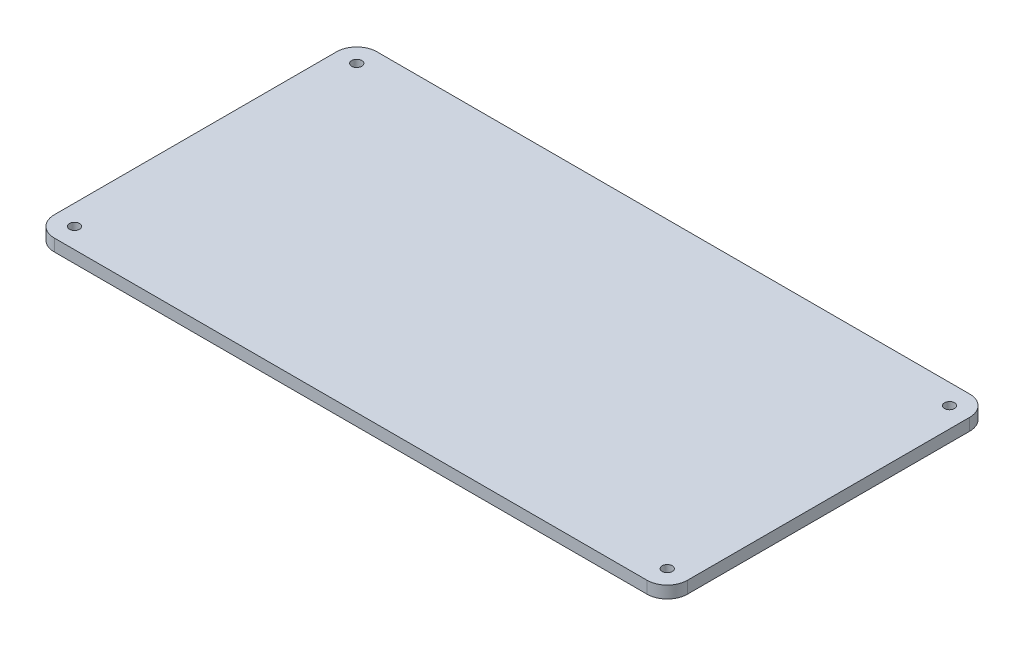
ISO-10303-21;
HEADER;
FILE_DESCRIPTION(('STEP AP214'),'2;1');
FILE_NAME('part.step','',(''),(''),'','','');
FILE_SCHEMA(('AUTOMOTIVE_DESIGN { 1 0 10303 214 1 1 1 1 }'));
ENDSEC;
DATA;
#1=APPLICATION_CONTEXT('core data for automotive mechanical design processes');
#2=APPLICATION_PROTOCOL_DEFINITION('international standard','automotive_design',2000,#1);
#3=PRODUCT_CONTEXT('',#1,'mechanical');
#4=PRODUCT('Part','Part','',(#3));
#5=PRODUCT_RELATED_PRODUCT_CATEGORY('part','',(#4));
#6=PRODUCT_DEFINITION_FORMATION('','',#4);
#7=PRODUCT_DEFINITION_CONTEXT('part definition',#1,'design');
#8=PRODUCT_DEFINITION('design','',#6,#7);
#9=PRODUCT_DEFINITION_SHAPE('','',#8);
#10=(LENGTH_UNIT() NAMED_UNIT(*) SI_UNIT(.MILLI.,.METRE.));
#11=(NAMED_UNIT(*) PLANE_ANGLE_UNIT() SI_UNIT($,.RADIAN.));
#12=(NAMED_UNIT(*) SI_UNIT($,.STERADIAN.) SOLID_ANGLE_UNIT());
#13=UNCERTAINTY_MEASURE_WITH_UNIT(LENGTH_MEASURE(1.E-05),#10,'distance_accuracy_value','');
#14=(GEOMETRIC_REPRESENTATION_CONTEXT(3) GLOBAL_UNCERTAINTY_ASSIGNED_CONTEXT((#13)) GLOBAL_UNIT_ASSIGNED_CONTEXT((#10,
#11,#12)) REPRESENTATION_CONTEXT('',''));
#15=CARTESIAN_POINT('',(0.,0.,0.));
#16=DIRECTION('',(0.,0.,1.));
#17=DIRECTION('',(1.,0.,0.));
#18=AXIS2_PLACEMENT_3D('',#15,#16,#17);
#19=CARTESIAN_POINT('',(157.,3.,40.));
#20=DIRECTION('',(-1.,0.,0.));
#21=DIRECTION('',(0.,0.,1.));
#22=AXIS2_PLACEMENT_3D('',#19,#20,#21);
#23=PLANE('',#22);
#24=DIRECTION('',(0.,0.,-1.));
#25=VECTOR('',#24,1.);
#26=CARTESIAN_POINT('',(157.,3.,40.));
#27=LINE('',#26,#25);
#28=CARTESIAN_POINT('',(157.,3.,35.));
#29=VERTEX_POINT('',#28);
#30=CARTESIAN_POINT('',(157.,3.,-35.));
#31=VERTEX_POINT('',#30);
#32=EDGE_CURVE('E129',#29,#31,#27,.T.);
#33=ORIENTED_EDGE('',*,*,#32,.F.);
#34=DIRECTION('',(0.,-1.,0.));
#35=VECTOR('',#34,1.);
#36=CARTESIAN_POINT('',(157.,3.,35.));
#37=LINE('',#36,#35);
#38=CARTESIAN_POINT('',(157.,0.,35.));
#39=VERTEX_POINT('',#38);
#40=EDGE_CURVE('E114',#29,#39,#37,.T.);
#41=ORIENTED_EDGE('',*,*,#40,.T.);
#42=DIRECTION('',(0.,0.,-1.));
#43=VECTOR('',#42,1.);
#44=CARTESIAN_POINT('',(157.,0.,40.));
#45=LINE('',#44,#43);
#46=CARTESIAN_POINT('',(157.,0.,-35.));
#47=VERTEX_POINT('',#46);
#48=EDGE_CURVE('E126',#39,#47,#45,.T.);
#49=ORIENTED_EDGE('',*,*,#48,.T.);
#50=DIRECTION('',(0.,-1.,0.));
#51=VECTOR('',#50,1.);
#52=CARTESIAN_POINT('',(157.,3.,-35.));
#53=LINE('',#52,#51);
#54=EDGE_CURVE('E131',#47,#31,#53,.F.);
#55=ORIENTED_EDGE('',*,*,#54,.T.);
#56=EDGE_LOOP('',(#33,#41,#49,#55));
#57=FACE_BOUND('',#56,.T.);
#58=ADVANCED_FACE('F42',(#57),#23,.F.);
#59=CARTESIAN_POINT('',(77.,3.,-40.));
#60=DIRECTION('',(0.,0.,1.));
#61=DIRECTION('',(1.,0.,0.));
#62=AXIS2_PLACEMENT_3D('',#59,#60,#61);
#63=PLANE('',#62);
#64=DIRECTION('',(-1.,0.,0.));
#65=VECTOR('',#64,1.);
#66=CARTESIAN_POINT('',(77.,0.,-40.));
#67=LINE('',#66,#65);
#68=CARTESIAN_POINT('',(152.,0.,-40.));
#69=VERTEX_POINT('',#68);
#70=CARTESIAN_POINT('',(5.,0.,-40.));
#71=VERTEX_POINT('',#70);
#72=EDGE_CURVE('E135',#69,#71,#67,.T.);
#73=ORIENTED_EDGE('',*,*,#72,.T.);
#74=DIRECTION('',(0.,-1.,0.));
#75=VECTOR('',#74,1.);
#76=CARTESIAN_POINT('',(5.,3.,-40.));
#77=LINE('',#76,#75);
#78=CARTESIAN_POINT('',(5.,3.,-40.));
#79=VERTEX_POINT('',#78);
#80=EDGE_CURVE('E11',#71,#79,#77,.F.);
#81=ORIENTED_EDGE('',*,*,#80,.T.);
#82=DIRECTION('',(-1.,0.,0.));
#83=VECTOR('',#82,1.);
#84=CARTESIAN_POINT('',(77.,3.,-40.));
#85=LINE('',#84,#83);
#86=CARTESIAN_POINT('',(152.,3.,-40.));
#87=VERTEX_POINT('',#86);
#88=EDGE_CURVE('E209',#87,#79,#85,.T.);
#89=ORIENTED_EDGE('',*,*,#88,.F.);
#90=DIRECTION('',(0.,-1.,0.));
#91=VECTOR('',#90,1.);
#92=CARTESIAN_POINT('',(152.,3.,-40.));
#93=LINE('',#92,#91);
#94=EDGE_CURVE('E51',#87,#69,#93,.T.);
#95=ORIENTED_EDGE('',*,*,#94,.T.);
#96=EDGE_LOOP('',(#73,#81,#89,#95));
#97=FACE_BOUND('',#96,.T.);
#98=ADVANCED_FACE('F226',(#97),#63,.F.);
#99=CARTESIAN_POINT('',(0.,3.,30.));
#100=DIRECTION('',(1.,0.,0.));
#101=DIRECTION('',(0.,0.,-1.));
#102=AXIS2_PLACEMENT_3D('',#99,#100,#101);
#103=PLANE('',#102);
#104=DIRECTION('',(0.,0.,1.));
#105=VECTOR('',#104,1.);
#106=CARTESIAN_POINT('',(0.,0.,30.));
#107=LINE('',#106,#105);
#108=CARTESIAN_POINT('',(0.,0.,-35.));
#109=VERTEX_POINT('',#108);
#110=CARTESIAN_POINT('',(0.,0.,35.));
#111=VERTEX_POINT('',#110);
#112=EDGE_CURVE('E138',#109,#111,#107,.T.);
#113=ORIENTED_EDGE('',*,*,#112,.T.);
#114=DIRECTION('',(0.,-1.,0.));
#115=VECTOR('',#114,1.);
#116=CARTESIAN_POINT('',(0.,3.,35.));
#117=LINE('',#116,#115);
#118=CARTESIAN_POINT('',(0.,3.,35.));
#119=VERTEX_POINT('',#118);
#120=EDGE_CURVE('E59',#111,#119,#117,.F.);
#121=ORIENTED_EDGE('',*,*,#120,.T.);
#122=DIRECTION('',(0.,0.,1.));
#123=VECTOR('',#122,1.);
#124=CARTESIAN_POINT('',(0.,3.,-40.));
#125=LINE('',#124,#123);
#126=CARTESIAN_POINT('',(0.,3.,-35.));
#127=VERTEX_POINT('',#126);
#128=EDGE_CURVE('E210',#127,#119,#125,.T.);
#129=ORIENTED_EDGE('',*,*,#128,.F.);
#130=DIRECTION('',(0.,-1.,0.));
#131=VECTOR('',#130,1.);
#132=CARTESIAN_POINT('',(0.,3.,-35.));
#133=LINE('',#132,#131);
#134=EDGE_CURVE('E164',#127,#109,#133,.T.);
#135=ORIENTED_EDGE('',*,*,#134,.T.);
#136=EDGE_LOOP('',(#113,#121,#129,#135));
#137=FACE_BOUND('',#136,.T.);
#138=ADVANCED_FACE('F220',(#137),#103,.F.);
#139=CARTESIAN_POINT('',(77.,3.,40.));
#140=DIRECTION('',(0.,0.,-1.));
#141=DIRECTION('',(-1.,0.,0.));
#142=AXIS2_PLACEMENT_3D('',#139,#140,#141);
#143=PLANE('',#142);
#144=DIRECTION('',(1.,0.,0.));
#145=VECTOR('',#144,1.);
#146=CARTESIAN_POINT('',(77.,0.,40.));
#147=LINE('',#146,#145);
#148=CARTESIAN_POINT('',(5.,0.,40.));
#149=VERTEX_POINT('',#148);
#150=CARTESIAN_POINT('',(152.,0.,40.));
#151=VERTEX_POINT('',#150);
#152=EDGE_CURVE('E147',#149,#151,#147,.T.);
#153=ORIENTED_EDGE('',*,*,#152,.T.);
#154=DIRECTION('',(0.,-1.,0.));
#155=VECTOR('',#154,1.);
#156=CARTESIAN_POINT('',(152.,3.,40.));
#157=LINE('',#156,#155);
#158=CARTESIAN_POINT('',(152.,3.,40.));
#159=VERTEX_POINT('',#158);
#160=EDGE_CURVE('E115',#151,#159,#157,.F.);
#161=ORIENTED_EDGE('',*,*,#160,.T.);
#162=DIRECTION('',(1.,0.,0.));
#163=VECTOR('',#162,1.);
#164=CARTESIAN_POINT('',(0.,3.,40.));
#165=LINE('',#164,#163);
#166=CARTESIAN_POINT('',(5.,3.,40.));
#167=VERTEX_POINT('',#166);
#168=EDGE_CURVE('E143',#167,#159,#165,.T.);
#169=ORIENTED_EDGE('',*,*,#168,.F.);
#170=DIRECTION('',(0.,-1.,0.));
#171=VECTOR('',#170,1.);
#172=CARTESIAN_POINT('',(5.,3.,40.));
#173=LINE('',#172,#171);
#174=EDGE_CURVE('E120',#167,#149,#173,.T.);
#175=ORIENTED_EDGE('',*,*,#174,.T.);
#176=EDGE_LOOP('',(#153,#161,#169,#175));
#177=FACE_BOUND('',#176,.T.);
#178=ADVANCED_FACE('F216',(#177),#143,.F.);
#179=CARTESIAN_POINT('',(0.,3.,0.));
#180=DIRECTION('',(0.,-1.,0.));
#181=DIRECTION('',(0.,0.,-1.));
#182=AXIS2_PLACEMENT_3D('',#179,#180,#181);
#183=PLANE('',#182);
#184=CARTESIAN_POINT('',(5.,3.,35.));
#185=DIRECTION('',(0.,1.,0.));
#186=DIRECTION('',(0.,0.,1.));
#187=AXIS2_PLACEMENT_3D('',#184,#185,#186);
#188=CIRCLE('',#187,1.25);
#189=CARTESIAN_POINT('',(5.,3.,36.25));
#190=VERTEX_POINT('',#189);
#191=EDGE_CURVE('E206',#190,#190,#188,.T.);
#192=ORIENTED_EDGE('',*,*,#191,.F.);
#193=EDGE_LOOP('',(#192));
#194=FACE_BOUND('',#193,.T.);
#195=CARTESIAN_POINT('',(152.,3.,35.));
#196=DIRECTION('',(0.,1.,0.));
#197=DIRECTION('',(0.,0.,1.));
#198=AXIS2_PLACEMENT_3D('',#195,#196,#197);
#199=CIRCLE('',#198,1.25000000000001);
#200=CARTESIAN_POINT('',(152.,3.,36.25));
#201=VERTEX_POINT('',#200);
#202=EDGE_CURVE('E202',#201,#201,#199,.T.);
#203=ORIENTED_EDGE('',*,*,#202,.F.);
#204=EDGE_LOOP('',(#203));
#205=FACE_BOUND('',#204,.T.);
#206=CARTESIAN_POINT('',(152.,3.,-35.));
#207=DIRECTION('',(0.,1.,0.));
#208=DIRECTION('',(0.,0.,1.));
#209=AXIS2_PLACEMENT_3D('',#206,#207,#208);
#210=CIRCLE('',#209,1.25000000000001);
#211=CARTESIAN_POINT('',(152.,3.,-33.75));
#212=VERTEX_POINT('',#211);
#213=EDGE_CURVE('E199',#212,#212,#210,.T.);
#214=ORIENTED_EDGE('',*,*,#213,.F.);
#215=EDGE_LOOP('',(#214));
#216=FACE_BOUND('',#215,.T.);
#217=CARTESIAN_POINT('',(5.,3.,-35.));
#218=DIRECTION('',(0.,1.,0.));
#219=DIRECTION('',(0.,0.,1.));
#220=AXIS2_PLACEMENT_3D('',#217,#218,#219);
#221=CIRCLE('',#220,1.25);
#222=CARTESIAN_POINT('',(5.,3.,-33.75));
#223=VERTEX_POINT('',#222);
#224=EDGE_CURVE('E174',#223,#223,#221,.T.);
#225=ORIENTED_EDGE('',*,*,#224,.F.);
#226=EDGE_LOOP('',(#225));
#227=FACE_BOUND('',#226,.T.);
#228=ORIENTED_EDGE('',*,*,#168,.T.);
#229=CARTESIAN_POINT('',(152.,3.,35.));
#230=DIRECTION('',(0.,-1.,0.));
#231=DIRECTION('',(0.,0.,-1.));
#232=AXIS2_PLACEMENT_3D('',#229,#230,#231);
#233=CIRCLE('',#232,5.);
#234=EDGE_CURVE('E162',#159,#29,#233,.F.);
#235=ORIENTED_EDGE('',*,*,#234,.T.);
#236=ORIENTED_EDGE('',*,*,#32,.T.);
#237=CARTESIAN_POINT('',(152.,3.,-35.));
#238=DIRECTION('',(0.,-1.,0.));
#239=DIRECTION('',(0.,0.,-1.));
#240=AXIS2_PLACEMENT_3D('',#237,#238,#239);
#241=CIRCLE('',#240,5.);
#242=EDGE_CURVE('E157',#31,#87,#241,.F.);
#243=ORIENTED_EDGE('',*,*,#242,.T.);
#244=ORIENTED_EDGE('',*,*,#88,.T.);
#245=CARTESIAN_POINT('',(5.,3.,-35.));
#246=DIRECTION('',(0.,-1.,0.));
#247=DIRECTION('',(0.,0.,-1.));
#248=AXIS2_PLACEMENT_3D('',#245,#246,#247);
#249=CIRCLE('',#248,5.);
#250=EDGE_CURVE('E66',#79,#127,#249,.F.);
#251=ORIENTED_EDGE('',*,*,#250,.T.);
#252=ORIENTED_EDGE('',*,*,#128,.T.);
#253=CARTESIAN_POINT('',(5.,3.,35.));
#254=DIRECTION('',(0.,-1.,0.));
#255=DIRECTION('',(0.,0.,-1.));
#256=AXIS2_PLACEMENT_3D('',#253,#254,#255);
#257=CIRCLE('',#256,5.);
#258=EDGE_CURVE('E160',#119,#167,#257,.F.);
#259=ORIENTED_EDGE('',*,*,#258,.T.);
#260=EDGE_LOOP('',(#228,#235,#236,#243,#244,#251,#252,#259));
#261=FACE_BOUND('',#260,.T.);
#262=ADVANCED_FACE('F184',(#194,#205,#216,#227,#261),#183,.F.);
#263=CARTESIAN_POINT('',(0.,0.,0.));
#264=DIRECTION('',(0.,-1.,0.));
#265=DIRECTION('',(0.,0.,-1.));
#266=AXIS2_PLACEMENT_3D('',#263,#264,#265);
#267=PLANE('',#266);
#268=CARTESIAN_POINT('',(5.,0.,35.));
#269=DIRECTION('',(0.,-1.,0.));
#270=DIRECTION('',(0.,0.,-1.));
#271=AXIS2_PLACEMENT_3D('',#268,#269,#270);
#272=CIRCLE('',#271,1.25);
#273=CARTESIAN_POINT('',(5.,0.,33.75));
#274=VERTEX_POINT('',#273);
#275=EDGE_CURVE('E46',#274,#274,#272,.T.);
#276=ORIENTED_EDGE('',*,*,#275,.F.);
#277=EDGE_LOOP('',(#276));
#278=FACE_BOUND('',#277,.T.);
#279=CARTESIAN_POINT('',(152.,0.,35.));
#280=DIRECTION('',(0.,-1.,0.));
#281=DIRECTION('',(0.,0.,-1.));
#282=AXIS2_PLACEMENT_3D('',#279,#280,#281);
#283=CIRCLE('',#282,1.25000000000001);
#284=CARTESIAN_POINT('',(152.,0.,33.75));
#285=VERTEX_POINT('',#284);
#286=EDGE_CURVE('E141',#285,#285,#283,.T.);
#287=ORIENTED_EDGE('',*,*,#286,.F.);
#288=EDGE_LOOP('',(#287));
#289=FACE_BOUND('',#288,.T.);
#290=CARTESIAN_POINT('',(152.,0.,-35.));
#291=DIRECTION('',(0.,-1.,0.));
#292=DIRECTION('',(0.,0.,-1.));
#293=AXIS2_PLACEMENT_3D('',#290,#291,#292);
#294=CIRCLE('',#293,1.25000000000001);
#295=CARTESIAN_POINT('',(152.,0.,-36.25));
#296=VERTEX_POINT('',#295);
#297=EDGE_CURVE('E173',#296,#296,#294,.T.);
#298=ORIENTED_EDGE('',*,*,#297,.F.);
#299=EDGE_LOOP('',(#298));
#300=FACE_BOUND('',#299,.T.);
#301=CARTESIAN_POINT('',(5.,0.,-35.));
#302=DIRECTION('',(0.,-1.,0.));
#303=DIRECTION('',(0.,0.,-1.));
#304=AXIS2_PLACEMENT_3D('',#301,#302,#303);
#305=CIRCLE('',#304,1.25);
#306=CARTESIAN_POINT('',(5.,0.,-36.25));
#307=VERTEX_POINT('',#306);
#308=EDGE_CURVE('E170',#307,#307,#305,.T.);
#309=ORIENTED_EDGE('',*,*,#308,.F.);
#310=EDGE_LOOP('',(#309));
#311=FACE_BOUND('',#310,.T.);
#312=ORIENTED_EDGE('',*,*,#48,.F.);
#313=CARTESIAN_POINT('',(152.,0.,35.));
#314=DIRECTION('',(0.,-1.,0.));
#315=DIRECTION('',(0.,0.,-1.));
#316=AXIS2_PLACEMENT_3D('',#313,#314,#315);
#317=CIRCLE('',#316,5.);
#318=EDGE_CURVE('E110',#39,#151,#317,.T.);
#319=ORIENTED_EDGE('',*,*,#318,.T.);
#320=ORIENTED_EDGE('',*,*,#152,.F.);
#321=CARTESIAN_POINT('',(5.,0.,35.));
#322=DIRECTION('',(0.,-1.,0.));
#323=DIRECTION('',(0.,0.,-1.));
#324=AXIS2_PLACEMENT_3D('',#321,#322,#323);
#325=CIRCLE('',#324,5.);
#326=EDGE_CURVE('E121',#149,#111,#325,.T.);
#327=ORIENTED_EDGE('',*,*,#326,.T.);
#328=ORIENTED_EDGE('',*,*,#112,.F.);
#329=CARTESIAN_POINT('',(5.,0.,-35.));
#330=DIRECTION('',(0.,-1.,0.));
#331=DIRECTION('',(0.,0.,-1.));
#332=AXIS2_PLACEMENT_3D('',#329,#330,#331);
#333=CIRCLE('',#332,5.);
#334=EDGE_CURVE('E151',#109,#71,#333,.T.);
#335=ORIENTED_EDGE('',*,*,#334,.T.);
#336=ORIENTED_EDGE('',*,*,#72,.F.);
#337=CARTESIAN_POINT('',(152.,0.,-35.));
#338=DIRECTION('',(0.,-1.,0.));
#339=DIRECTION('',(0.,0.,-1.));
#340=AXIS2_PLACEMENT_3D('',#337,#338,#339);
#341=CIRCLE('',#340,5.);
#342=EDGE_CURVE('E130',#69,#47,#341,.T.);
#343=ORIENTED_EDGE('',*,*,#342,.T.);
#344=EDGE_LOOP('',(#312,#319,#320,#327,#328,#335,#336,#343));
#345=FACE_BOUND('',#344,.T.);
#346=ADVANCED_FACE('F133',(#278,#289,#300,#311,#345),#267,.T.);
#347=CARTESIAN_POINT('',(152.,3.,35.));
#348=DIRECTION('',(0.,-1.,0.));
#349=DIRECTION('',(0.,0.,-1.));
#350=AXIS2_PLACEMENT_3D('',#347,#348,#349);
#351=CYLINDRICAL_SURFACE('',#350,5.);
#352=ORIENTED_EDGE('',*,*,#234,.F.);
#353=ORIENTED_EDGE('',*,*,#160,.F.);
#354=ORIENTED_EDGE('',*,*,#318,.F.);
#355=ORIENTED_EDGE('',*,*,#40,.F.);
#356=EDGE_LOOP('',(#352,#353,#354,#355));
#357=FACE_BOUND('',#356,.T.);
#358=ADVANCED_FACE('F113',(#357),#351,.T.);
#359=CARTESIAN_POINT('',(5.,3.,35.));
#360=DIRECTION('',(0.,-1.,0.));
#361=DIRECTION('',(0.,0.,-1.));
#362=AXIS2_PLACEMENT_3D('',#359,#360,#361);
#363=CYLINDRICAL_SURFACE('',#362,5.);
#364=ORIENTED_EDGE('',*,*,#258,.F.);
#365=ORIENTED_EDGE('',*,*,#120,.F.);
#366=ORIENTED_EDGE('',*,*,#326,.F.);
#367=ORIENTED_EDGE('',*,*,#174,.F.);
#368=EDGE_LOOP('',(#364,#365,#366,#367));
#369=FACE_BOUND('',#368,.T.);
#370=ADVANCED_FACE('F218',(#369),#363,.T.);
#371=CARTESIAN_POINT('',(5.,3.,-35.));
#372=DIRECTION('',(0.,-1.,0.));
#373=DIRECTION('',(0.,0.,-1.));
#374=AXIS2_PLACEMENT_3D('',#371,#372,#373);
#375=CYLINDRICAL_SURFACE('',#374,5.);
#376=ORIENTED_EDGE('',*,*,#250,.F.);
#377=ORIENTED_EDGE('',*,*,#80,.F.);
#378=ORIENTED_EDGE('',*,*,#334,.F.);
#379=ORIENTED_EDGE('',*,*,#134,.F.);
#380=EDGE_LOOP('',(#376,#377,#378,#379));
#381=FACE_BOUND('',#380,.T.);
#382=ADVANCED_FACE('F223',(#381),#375,.T.);
#383=CARTESIAN_POINT('',(152.,3.,-35.));
#384=DIRECTION('',(0.,-1.,0.));
#385=DIRECTION('',(0.,0.,-1.));
#386=AXIS2_PLACEMENT_3D('',#383,#384,#385);
#387=CYLINDRICAL_SURFACE('',#386,5.);
#388=ORIENTED_EDGE('',*,*,#242,.F.);
#389=ORIENTED_EDGE('',*,*,#54,.F.);
#390=ORIENTED_EDGE('',*,*,#342,.F.);
#391=ORIENTED_EDGE('',*,*,#94,.F.);
#392=EDGE_LOOP('',(#388,#389,#390,#391));
#393=FACE_BOUND('',#392,.T.);
#394=ADVANCED_FACE('F44',(#393),#387,.T.);
#395=CARTESIAN_POINT('',(5.,-7.,-35.));
#396=DIRECTION('',(0.,1.,0.));
#397=DIRECTION('',(0.,0.,1.));
#398=AXIS2_PLACEMENT_3D('',#395,#396,#397);
#399=CYLINDRICAL_SURFACE('',#398,1.25);
#400=ORIENTED_EDGE('',*,*,#308,.T.);
#401=EDGE_LOOP('',(#400));
#402=FACE_BOUND('',#401,.T.);
#403=ORIENTED_EDGE('',*,*,#224,.T.);
#404=EDGE_LOOP('',(#403));
#405=FACE_BOUND('',#404,.T.);
#406=ADVANCED_FACE('F191',(#402,#405),#399,.F.);
#407=CARTESIAN_POINT('',(152.,-7.,-35.));
#408=DIRECTION('',(0.,1.,0.));
#409=DIRECTION('',(0.,0.,1.));
#410=AXIS2_PLACEMENT_3D('',#407,#408,#409);
#411=CYLINDRICAL_SURFACE('',#410,1.25000000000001);
#412=ORIENTED_EDGE('',*,*,#297,.T.);
#413=EDGE_LOOP('',(#412));
#414=FACE_BOUND('',#413,.T.);
#415=ORIENTED_EDGE('',*,*,#213,.T.);
#416=EDGE_LOOP('',(#415));
#417=FACE_BOUND('',#416,.T.);
#418=ADVANCED_FACE('F194',(#414,#417),#411,.F.);
#419=CARTESIAN_POINT('',(152.,-7.,35.));
#420=DIRECTION('',(0.,1.,0.));
#421=DIRECTION('',(0.,0.,1.));
#422=AXIS2_PLACEMENT_3D('',#419,#420,#421);
#423=CYLINDRICAL_SURFACE('',#422,1.25000000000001);
#424=ORIENTED_EDGE('',*,*,#286,.T.);
#425=EDGE_LOOP('',(#424));
#426=FACE_BOUND('',#425,.T.);
#427=ORIENTED_EDGE('',*,*,#202,.T.);
#428=EDGE_LOOP('',(#427));
#429=FACE_BOUND('',#428,.T.);
#430=ADVANCED_FACE('F179',(#426,#429),#423,.F.);
#431=CARTESIAN_POINT('',(5.,-7.,35.));
#432=DIRECTION('',(0.,1.,0.));
#433=DIRECTION('',(0.,0.,1.));
#434=AXIS2_PLACEMENT_3D('',#431,#432,#433);
#435=CYLINDRICAL_SURFACE('',#434,1.25);
#436=ORIENTED_EDGE('',*,*,#275,.T.);
#437=EDGE_LOOP('',(#436));
#438=FACE_BOUND('',#437,.T.);
#439=ORIENTED_EDGE('',*,*,#191,.T.);
#440=EDGE_LOOP('',(#439));
#441=FACE_BOUND('',#440,.T.);
#442=ADVANCED_FACE('F298',(#438,#441),#435,.F.);
#443=CLOSED_SHELL('',(#58,#98,#138,#178,#262,#346,#358,#370,#382,#394,#406,#418,#430,#442));
#444=MANIFOLD_SOLID_BREP('B2',#443);
#445=ADVANCED_BREP_SHAPE_REPRESENTATION('',(#18,#444),#14);
#446=SHAPE_DEFINITION_REPRESENTATION(#9,#445);
ENDSEC;
END-ISO-10303-21;
